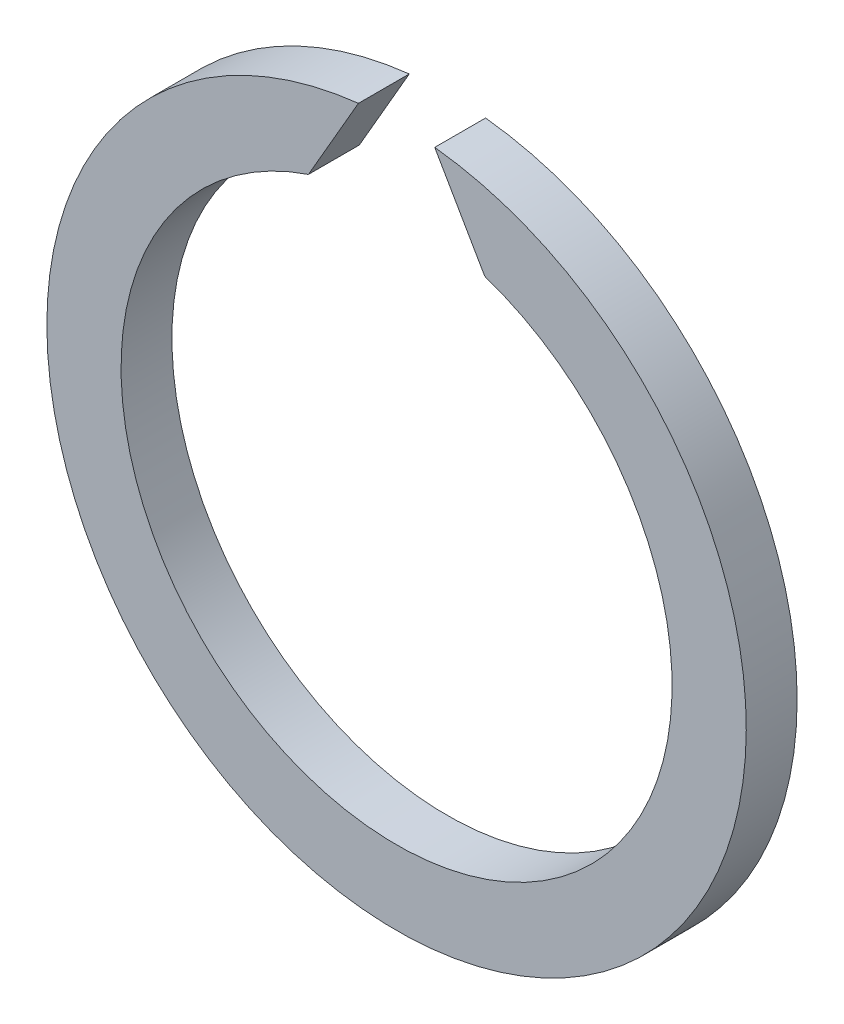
from build123d import *

# Parameters (mm, degrees)
BOSS_EXTRUDE1_DEPTH = 1.2


with BuildPart() as part:
    # Sketch1 → Boss-Extrude1 (new body)
    with BuildSketch(Plane.XY):
        with BuildLine():
            Line((-2.079087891, 6.158522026), (-0.9, 8.20076216))
            ThreePointArc((-0.9, 8.20076216), (0, -8.25), (0.9, 8.20076216))
            Line((0.9, 8.20076216), (2.079087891, 6.158522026))
            ThreePointArc((2.079087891, 6.158522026), (0, -6.5), (-2.079087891, 6.158522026))
        make_face()
    extrude(amount=BOSS_EXTRUDE1_DEPTH)


solid = part.part
